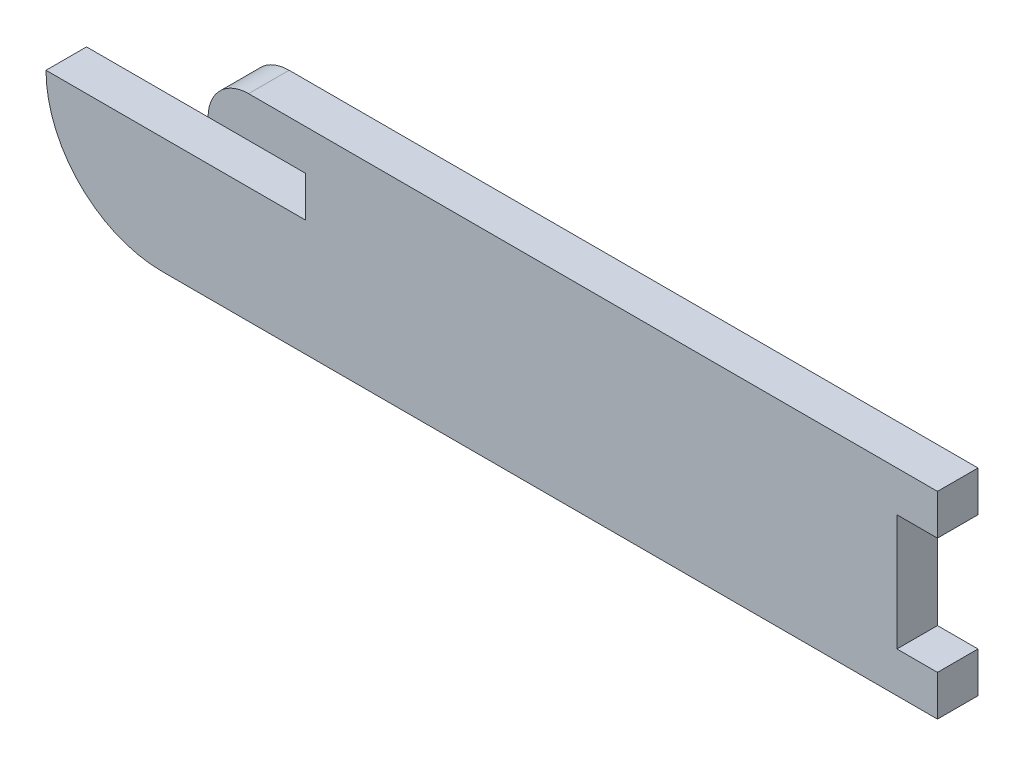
ISO-10303-21;
HEADER;
FILE_DESCRIPTION(('STEP AP214'),'2;1');
FILE_NAME('part.step','',(''),(''),'','','');
FILE_SCHEMA(('AUTOMOTIVE_DESIGN { 1 0 10303 214 1 1 1 1 }'));
ENDSEC;
DATA;
#1=APPLICATION_CONTEXT('core data for automotive mechanical design processes');
#2=APPLICATION_PROTOCOL_DEFINITION('international standard','automotive_design',2000,#1);
#3=PRODUCT_CONTEXT('',#1,'mechanical');
#4=PRODUCT('Part','Part','',(#3));
#5=PRODUCT_RELATED_PRODUCT_CATEGORY('part','',(#4));
#6=PRODUCT_DEFINITION_FORMATION('','',#4);
#7=PRODUCT_DEFINITION_CONTEXT('part definition',#1,'design');
#8=PRODUCT_DEFINITION('design','',#6,#7);
#9=PRODUCT_DEFINITION_SHAPE('','',#8);
#10=(LENGTH_UNIT() NAMED_UNIT(*) SI_UNIT(.MILLI.,.METRE.));
#11=(NAMED_UNIT(*) PLANE_ANGLE_UNIT() SI_UNIT($,.RADIAN.));
#12=(NAMED_UNIT(*) SI_UNIT($,.STERADIAN.) SOLID_ANGLE_UNIT());
#13=UNCERTAINTY_MEASURE_WITH_UNIT(LENGTH_MEASURE(1.E-05),#10,'distance_accuracy_value','');
#14=(GEOMETRIC_REPRESENTATION_CONTEXT(3) GLOBAL_UNCERTAINTY_ASSIGNED_CONTEXT((#13)) GLOBAL_UNIT_ASSIGNED_CONTEXT((#10,
#11,#12)) REPRESENTATION_CONTEXT('',''));
#15=CARTESIAN_POINT('',(0.,0.,0.));
#16=DIRECTION('',(0.,0.,1.));
#17=DIRECTION('',(1.,0.,0.));
#18=AXIS2_PLACEMENT_3D('',#15,#16,#17);
#19=CARTESIAN_POINT('',(28.575,7.72795,1.5875));
#20=DIRECTION('',(-1.,0.,0.));
#21=DIRECTION('',(0.,0.,1.));
#22=AXIS2_PLACEMENT_3D('',#19,#20,#21);
#23=PLANE('',#22);
#24=DIRECTION('',(0.,1.,0.));
#25=VECTOR('',#24,1.);
#26=CARTESIAN_POINT('',(28.575,7.72795,-1.5875));
#27=LINE('',#26,#25);
#28=CARTESIAN_POINT('',(28.575,-7.72795,-1.5875));
#29=VERTEX_POINT('',#28);
#30=CARTESIAN_POINT('',(28.575,-4.55295,-1.5875));
#31=VERTEX_POINT('',#30);
#32=EDGE_CURVE('E200',#29,#31,#27,.T.);
#33=ORIENTED_EDGE('',*,*,#32,.T.);
#34=DIRECTION('',(0.,0.,1.));
#35=VECTOR('',#34,1.);
#36=CARTESIAN_POINT('',(28.575,-4.55295,-1.5875));
#37=LINE('',#36,#35);
#38=CARTESIAN_POINT('',(28.575,-4.55295,1.5875));
#39=VERTEX_POINT('',#38);
#40=EDGE_CURVE('E182',#31,#39,#37,.T.);
#41=ORIENTED_EDGE('',*,*,#40,.T.);
#42=DIRECTION('',(0.,1.,0.));
#43=VECTOR('',#42,1.);
#44=CARTESIAN_POINT('',(28.575,7.72795,1.5875));
#45=LINE('',#44,#43);
#46=CARTESIAN_POINT('',(28.575,-7.72795,1.5875));
#47=VERTEX_POINT('',#46);
#48=EDGE_CURVE('E191',#47,#39,#45,.T.);
#49=ORIENTED_EDGE('',*,*,#48,.F.);
#50=DIRECTION('',(0.,0.,-1.));
#51=VECTOR('',#50,1.);
#52=CARTESIAN_POINT('',(28.575,-7.72795,1.5875));
#53=LINE('',#52,#51);
#54=EDGE_CURVE('E199',#47,#29,#53,.T.);
#55=ORIENTED_EDGE('',*,*,#54,.T.);
#56=EDGE_LOOP('',(#33,#41,#49,#55));
#57=FACE_BOUND('',#56,.T.);
#58=ADVANCED_FACE('F31',(#57),#23,.F.);
#59=CARTESIAN_POINT('',(28.575,4.55295,1.5875));
#60=VERTEX_POINT('',#59);
#61=CARTESIAN_POINT('',(28.575,7.72795,1.5875));
#62=VERTEX_POINT('',#61);
#63=EDGE_CURVE('E195',#60,#62,#45,.T.);
#64=ORIENTED_EDGE('',*,*,#63,.F.);
#65=DIRECTION('',(0.,0.,1.));
#66=VECTOR('',#65,1.);
#67=CARTESIAN_POINT('',(28.575,4.55295,-1.5875));
#68=LINE('',#67,#66);
#69=CARTESIAN_POINT('',(28.575,4.55295,-1.5875));
#70=VERTEX_POINT('',#69);
#71=EDGE_CURVE('E175',#70,#60,#68,.T.);
#72=ORIENTED_EDGE('',*,*,#71,.F.);
#73=CARTESIAN_POINT('',(28.575,7.72795,-1.5875));
#74=VERTEX_POINT('',#73);
#75=EDGE_CURVE('E185',#70,#74,#27,.T.);
#76=ORIENTED_EDGE('',*,*,#75,.T.);
#77=DIRECTION('',(0.,0.,-1.));
#78=VECTOR('',#77,1.);
#79=CARTESIAN_POINT('',(28.575,7.72795,1.5875));
#80=LINE('',#79,#78);
#81=EDGE_CURVE('E208',#62,#74,#80,.T.);
#82=ORIENTED_EDGE('',*,*,#81,.F.);
#83=EDGE_LOOP('',(#64,#72,#76,#82));
#84=FACE_BOUND('',#83,.T.);
#85=ADVANCED_FACE('F215',(#84),#23,.F.);
#86=CARTESIAN_POINT('',(-28.575,7.72795,1.5875));
#87=DIRECTION('',(0.,-1.,0.));
#88=DIRECTION('',(0.,0.,-1.));
#89=AXIS2_PLACEMENT_3D('',#86,#87,#88);
#90=PLANE('',#89);
#91=DIRECTION('',(-1.,0.,0.));
#92=VECTOR('',#91,1.);
#93=CARTESIAN_POINT('',(-28.575,7.72795,-1.5875));
#94=LINE('',#93,#92);
#95=CARTESIAN_POINT('',(-25.4,7.72795,-1.5875));
#96=VERTEX_POINT('',#95);
#97=EDGE_CURVE('E203',#74,#96,#94,.T.);
#98=ORIENTED_EDGE('',*,*,#97,.T.);
#99=DIRECTION('',(0.,0.,-1.));
#100=VECTOR('',#99,1.);
#101=CARTESIAN_POINT('',(-25.4,7.72795,1.5875));
#102=LINE('',#101,#100);
#103=CARTESIAN_POINT('',(-25.4,7.72795,1.5875));
#104=VERTEX_POINT('',#103);
#105=EDGE_CURVE('E39',#96,#104,#102,.F.);
#106=ORIENTED_EDGE('',*,*,#105,.T.);
#107=DIRECTION('',(-1.,0.,0.));
#108=VECTOR('',#107,1.);
#109=CARTESIAN_POINT('',(-28.575,7.72795,1.5875));
#110=LINE('',#109,#108);
#111=EDGE_CURVE('E194',#62,#104,#110,.T.);
#112=ORIENTED_EDGE('',*,*,#111,.F.);
#113=ORIENTED_EDGE('',*,*,#81,.T.);
#114=EDGE_LOOP('',(#98,#106,#112,#113));
#115=FACE_BOUND('',#114,.T.);
#116=ADVANCED_FACE('F212',(#115),#90,.F.);
#117=CARTESIAN_POINT('',(-28.575,-7.72795,1.5875));
#118=DIRECTION('',(0.,1.,0.));
#119=DIRECTION('',(0.,0.,1.));
#120=AXIS2_PLACEMENT_3D('',#117,#118,#119);
#121=PLANE('',#120);
#122=DIRECTION('',(1.,0.,0.));
#123=VECTOR('',#122,1.);
#124=CARTESIAN_POINT('',(-28.575,-7.72795,1.5875));
#125=LINE('',#124,#123);
#126=CARTESIAN_POINT('',(-32.1691,-7.72795,1.5875));
#127=VERTEX_POINT('',#126);
#128=EDGE_CURVE('E197',#127,#47,#125,.T.);
#129=ORIENTED_EDGE('',*,*,#128,.F.);
#130=DIRECTION('',(0.,0.,1.));
#131=VECTOR('',#130,1.);
#132=CARTESIAN_POINT('',(-32.1691,-7.72795,-1.5875));
#133=LINE('',#132,#131);
#134=CARTESIAN_POINT('',(-32.1691,-7.72795,-1.5875));
#135=VERTEX_POINT('',#134);
#136=EDGE_CURVE('E131',#135,#127,#133,.T.);
#137=ORIENTED_EDGE('',*,*,#136,.F.);
#138=DIRECTION('',(1.,0.,0.));
#139=VECTOR('',#138,1.);
#140=CARTESIAN_POINT('',(-28.575,-7.72795,-1.5875));
#141=LINE('',#140,#139);
#142=EDGE_CURVE('E139',#135,#29,#141,.T.);
#143=ORIENTED_EDGE('',*,*,#142,.T.);
#144=ORIENTED_EDGE('',*,*,#54,.F.);
#145=EDGE_LOOP('',(#129,#137,#143,#144));
#146=FACE_BOUND('',#145,.T.);
#147=ADVANCED_FACE('F234',(#146),#121,.F.);
#148=CARTESIAN_POINT('',(28.575,-7.72795,1.5875));
#149=DIRECTION('',(0.,0.,1.));
#150=DIRECTION('',(1.,0.,0.));
#151=AXIS2_PLACEMENT_3D('',#148,#149,#150);
#152=PLANE('',#151);
#153=ORIENTED_EDGE('',*,*,#111,.T.);
#154=CARTESIAN_POINT('',(-25.4,4.55295,1.5875));
#155=DIRECTION('',(0.,0.,1.));
#156=DIRECTION('',(1.,0.,0.));
#157=AXIS2_PLACEMENT_3D('',#154,#155,#156);
#158=CIRCLE('',#157,3.175);
#159=CARTESIAN_POINT('',(-28.575,4.55295,1.5875));
#160=VERTEX_POINT('',#159);
#161=EDGE_CURVE('E11',#104,#160,#158,.T.);
#162=ORIENTED_EDGE('',*,*,#161,.T.);
#163=DIRECTION('',(-1.,0.,0.));
#164=VECTOR('',#163,1.);
#165=CARTESIAN_POINT('',(-28.575,4.55295,1.5875));
#166=LINE('',#165,#164);
#167=CARTESIAN_POINT('',(-20.955,4.55295,1.5875));
#168=VERTEX_POINT('',#167);
#169=EDGE_CURVE('E145',#168,#160,#166,.T.);
#170=ORIENTED_EDGE('',*,*,#169,.F.);
#171=DIRECTION('',(0.,1.,0.));
#172=VECTOR('',#171,1.);
#173=CARTESIAN_POINT('',(-20.955,4.55295,1.5875));
#174=LINE('',#173,#172);
#175=CARTESIAN_POINT('',(-20.955,1.37795,1.5875));
#176=VERTEX_POINT('',#175);
#177=EDGE_CURVE('E150',#176,#168,#174,.T.);
#178=ORIENTED_EDGE('',*,*,#177,.F.);
#179=DIRECTION('',(1.,0.,0.));
#180=VECTOR('',#179,1.);
#181=CARTESIAN_POINT('',(-28.575,1.37795,1.5875));
#182=LINE('',#181,#180);
#183=CARTESIAN_POINT('',(-41.275,1.37795,1.5875));
#184=VERTEX_POINT('',#183);
#185=EDGE_CURVE('E130',#184,#176,#182,.T.);
#186=ORIENTED_EDGE('',*,*,#185,.F.);
#187=CARTESIAN_POINT('',(-32.1691,1.37795,1.5875));
#188=DIRECTION('',(0.,0.,-1.));
#189=DIRECTION('',(1.,0.,0.));
#190=AXIS2_PLACEMENT_3D('',#187,#188,#189);
#191=CIRCLE('',#190,9.1059);
#192=EDGE_CURVE('E125',#127,#184,#191,.T.);
#193=ORIENTED_EDGE('',*,*,#192,.F.);
#194=ORIENTED_EDGE('',*,*,#128,.T.);
#195=ORIENTED_EDGE('',*,*,#48,.T.);
#196=DIRECTION('',(1.,0.,0.));
#197=VECTOR('',#196,1.);
#198=CARTESIAN_POINT('',(28.575,-4.55295,1.5875));
#199=LINE('',#198,#197);
#200=CARTESIAN_POINT('',(25.4,-4.55295,1.5875));
#201=VERTEX_POINT('',#200);
#202=EDGE_CURVE('E169',#201,#39,#199,.T.);
#203=ORIENTED_EDGE('',*,*,#202,.F.);
#204=DIRECTION('',(0.,-1.,0.));
#205=VECTOR('',#204,1.);
#206=CARTESIAN_POINT('',(25.4,4.55295,1.5875));
#207=LINE('',#206,#205);
#208=CARTESIAN_POINT('',(25.4,4.55295,1.5875));
#209=VERTEX_POINT('',#208);
#210=EDGE_CURVE('E178',#209,#201,#207,.T.);
#211=ORIENTED_EDGE('',*,*,#210,.F.);
#212=DIRECTION('',(-1.,0.,0.));
#213=VECTOR('',#212,1.);
#214=CARTESIAN_POINT('',(28.575,4.55295,1.5875));
#215=LINE('',#214,#213);
#216=EDGE_CURVE('E161',#60,#209,#215,.T.);
#217=ORIENTED_EDGE('',*,*,#216,.F.);
#218=ORIENTED_EDGE('',*,*,#63,.T.);
#219=EDGE_LOOP('',(#153,#162,#170,#178,#186,#193,#194,#195,#203,#211,#217,#218));
#220=FACE_BOUND('',#219,.T.);
#221=ADVANCED_FACE('F237',(#220),#152,.T.);
#222=CARTESIAN_POINT('',(28.575,-7.72795,-1.5875));
#223=DIRECTION('',(0.,0.,1.));
#224=DIRECTION('',(1.,0.,0.));
#225=AXIS2_PLACEMENT_3D('',#222,#223,#224);
#226=PLANE('',#225);
#227=DIRECTION('',(-1.,0.,0.));
#228=VECTOR('',#227,1.);
#229=CARTESIAN_POINT('',(-28.575,4.55295,-1.5875));
#230=LINE('',#229,#228);
#231=CARTESIAN_POINT('',(-20.955,4.55295,-1.5875));
#232=VERTEX_POINT('',#231);
#233=CARTESIAN_POINT('',(-28.575,4.55295,-1.5875));
#234=VERTEX_POINT('',#233);
#235=EDGE_CURVE('E147',#232,#234,#230,.T.);
#236=ORIENTED_EDGE('',*,*,#235,.T.);
#237=CARTESIAN_POINT('',(-25.4,4.55295,-1.5875));
#238=DIRECTION('',(0.,0.,1.));
#239=DIRECTION('',(1.,0.,0.));
#240=AXIS2_PLACEMENT_3D('',#237,#238,#239);
#241=CIRCLE('',#240,3.175);
#242=EDGE_CURVE('E53',#234,#96,#241,.F.);
#243=ORIENTED_EDGE('',*,*,#242,.T.);
#244=ORIENTED_EDGE('',*,*,#97,.F.);
#245=ORIENTED_EDGE('',*,*,#75,.F.);
#246=DIRECTION('',(-1.,0.,0.));
#247=VECTOR('',#246,1.);
#248=CARTESIAN_POINT('',(28.575,4.55295,-1.5875));
#249=LINE('',#248,#247);
#250=CARTESIAN_POINT('',(25.4,4.55295,-1.5875));
#251=VERTEX_POINT('',#250);
#252=EDGE_CURVE('E165',#70,#251,#249,.T.);
#253=ORIENTED_EDGE('',*,*,#252,.T.);
#254=DIRECTION('',(0.,-1.,0.));
#255=VECTOR('',#254,1.);
#256=CARTESIAN_POINT('',(25.4,4.55295,-1.5875));
#257=LINE('',#256,#255);
#258=CARTESIAN_POINT('',(25.4,-4.55295,-1.5875));
#259=VERTEX_POINT('',#258);
#260=EDGE_CURVE('E168',#251,#259,#257,.T.);
#261=ORIENTED_EDGE('',*,*,#260,.T.);
#262=DIRECTION('',(1.,0.,0.));
#263=VECTOR('',#262,1.);
#264=CARTESIAN_POINT('',(28.575,-4.55295,-1.5875));
#265=LINE('',#264,#263);
#266=EDGE_CURVE('E172',#259,#31,#265,.T.);
#267=ORIENTED_EDGE('',*,*,#266,.T.);
#268=ORIENTED_EDGE('',*,*,#32,.F.);
#269=ORIENTED_EDGE('',*,*,#142,.F.);
#270=CARTESIAN_POINT('',(-32.1691,1.37795,-1.5875));
#271=DIRECTION('',(0.,0.,-1.));
#272=DIRECTION('',(1.,0.,0.));
#273=AXIS2_PLACEMENT_3D('',#270,#271,#272);
#274=CIRCLE('',#273,9.1059);
#275=CARTESIAN_POINT('',(-41.275,1.37795,-1.5875));
#276=VERTEX_POINT('',#275);
#277=EDGE_CURVE('E122',#135,#276,#274,.T.);
#278=ORIENTED_EDGE('',*,*,#277,.T.);
#279=DIRECTION('',(1.,0.,0.));
#280=VECTOR('',#279,1.);
#281=CARTESIAN_POINT('',(-28.575,1.37795,-1.5875));
#282=LINE('',#281,#280);
#283=CARTESIAN_POINT('',(-20.955,1.37795,-1.5875));
#284=VERTEX_POINT('',#283);
#285=EDGE_CURVE('E137',#276,#284,#282,.T.);
#286=ORIENTED_EDGE('',*,*,#285,.T.);
#287=DIRECTION('',(0.,1.,0.));
#288=VECTOR('',#287,1.);
#289=CARTESIAN_POINT('',(-20.955,4.55295,-1.5875));
#290=LINE('',#289,#288);
#291=EDGE_CURVE('E144',#284,#232,#290,.T.);
#292=ORIENTED_EDGE('',*,*,#291,.T.);
#293=EDGE_LOOP('',(#236,#243,#244,#245,#253,#261,#267,#268,#269,#278,#286,#292));
#294=FACE_BOUND('',#293,.T.);
#295=ADVANCED_FACE('F135',(#294),#226,.F.);
#296=CARTESIAN_POINT('',(28.575,-4.55295,-1.5875));
#297=DIRECTION('',(0.,-1.,0.));
#298=DIRECTION('',(1.,0.,0.));
#299=AXIS2_PLACEMENT_3D('',#296,#297,#298);
#300=PLANE('',#299);
#301=ORIENTED_EDGE('',*,*,#202,.T.);
#302=ORIENTED_EDGE('',*,*,#40,.F.);
#303=ORIENTED_EDGE('',*,*,#266,.F.);
#304=DIRECTION('',(0.,0.,1.));
#305=VECTOR('',#304,1.);
#306=CARTESIAN_POINT('',(25.4,-4.55295,-1.5875));
#307=LINE('',#306,#305);
#308=EDGE_CURVE('E186',#259,#201,#307,.T.);
#309=ORIENTED_EDGE('',*,*,#308,.T.);
#310=EDGE_LOOP('',(#301,#302,#303,#309));
#311=FACE_BOUND('',#310,.T.);
#312=ADVANCED_FACE('F228',(#311),#300,.F.);
#313=CARTESIAN_POINT('',(25.4,4.55295,-1.5875));
#314=DIRECTION('',(-1.,0.,0.));
#315=DIRECTION('',(0.,-1.,0.));
#316=AXIS2_PLACEMENT_3D('',#313,#314,#315);
#317=PLANE('',#316);
#318=ORIENTED_EDGE('',*,*,#210,.T.);
#319=ORIENTED_EDGE('',*,*,#308,.F.);
#320=ORIENTED_EDGE('',*,*,#260,.F.);
#321=DIRECTION('',(0.,0.,1.));
#322=VECTOR('',#321,1.);
#323=CARTESIAN_POINT('',(25.4,4.55295,-1.5875));
#324=LINE('',#323,#322);
#325=EDGE_CURVE('E188',#251,#209,#324,.T.);
#326=ORIENTED_EDGE('',*,*,#325,.T.);
#327=EDGE_LOOP('',(#318,#319,#320,#326));
#328=FACE_BOUND('',#327,.T.);
#329=ADVANCED_FACE('F224',(#328),#317,.F.);
#330=CARTESIAN_POINT('',(28.575,4.55295,-1.5875));
#331=DIRECTION('',(0.,1.,0.));
#332=DIRECTION('',(-1.,0.,0.));
#333=AXIS2_PLACEMENT_3D('',#330,#331,#332);
#334=PLANE('',#333);
#335=ORIENTED_EDGE('',*,*,#216,.T.);
#336=ORIENTED_EDGE('',*,*,#325,.F.);
#337=ORIENTED_EDGE('',*,*,#252,.F.);
#338=ORIENTED_EDGE('',*,*,#71,.T.);
#339=EDGE_LOOP('',(#335,#336,#337,#338));
#340=FACE_BOUND('',#339,.T.);
#341=ADVANCED_FACE('F220',(#340),#334,.F.);
#342=CARTESIAN_POINT('',(-28.575,4.55295,-1.5875));
#343=DIRECTION('',(0.,1.,0.));
#344=DIRECTION('',(0.,0.,1.));
#345=AXIS2_PLACEMENT_3D('',#342,#343,#344);
#346=PLANE('',#345);
#347=ORIENTED_EDGE('',*,*,#169,.T.);
#348=DIRECTION('',(0.,0.,1.));
#349=VECTOR('',#348,1.);
#350=CARTESIAN_POINT('',(-28.575,4.55295,-1.5875));
#351=LINE('',#350,#349);
#352=EDGE_CURVE('E158',#234,#160,#351,.T.);
#353=ORIENTED_EDGE('',*,*,#352,.F.);
#354=ORIENTED_EDGE('',*,*,#235,.F.);
#355=DIRECTION('',(0.,0.,1.));
#356=VECTOR('',#355,1.);
#357=CARTESIAN_POINT('',(-20.955,4.55295,-1.5875));
#358=LINE('',#357,#356);
#359=EDGE_CURVE('E162',#232,#168,#358,.T.);
#360=ORIENTED_EDGE('',*,*,#359,.T.);
#361=EDGE_LOOP('',(#347,#353,#354,#360));
#362=FACE_BOUND('',#361,.T.);
#363=ADVANCED_FACE('F245',(#362),#346,.F.);
#364=CARTESIAN_POINT('',(-20.955,4.55295,-1.5875));
#365=DIRECTION('',(1.,0.,0.));
#366=DIRECTION('',(0.,0.,-1.));
#367=AXIS2_PLACEMENT_3D('',#364,#365,#366);
#368=PLANE('',#367);
#369=ORIENTED_EDGE('',*,*,#177,.T.);
#370=ORIENTED_EDGE('',*,*,#359,.F.);
#371=ORIENTED_EDGE('',*,*,#291,.F.);
#372=DIRECTION('',(0.,0.,1.));
#373=VECTOR('',#372,1.);
#374=CARTESIAN_POINT('',(-20.955,1.37795,-1.5875));
#375=LINE('',#374,#373);
#376=EDGE_CURVE('E143',#284,#176,#375,.T.);
#377=ORIENTED_EDGE('',*,*,#376,.T.);
#378=EDGE_LOOP('',(#369,#370,#371,#377));
#379=FACE_BOUND('',#378,.T.);
#380=ADVANCED_FACE('F241',(#379),#368,.F.);
#381=CARTESIAN_POINT('',(-28.575,1.37795,-1.5875));
#382=DIRECTION('',(0.,-1.,0.));
#383=DIRECTION('',(0.,0.,-1.));
#384=AXIS2_PLACEMENT_3D('',#381,#382,#383);
#385=PLANE('',#384);
#386=ORIENTED_EDGE('',*,*,#185,.T.);
#387=ORIENTED_EDGE('',*,*,#376,.F.);
#388=ORIENTED_EDGE('',*,*,#285,.F.);
#389=DIRECTION('',(0.,0.,1.));
#390=VECTOR('',#389,1.);
#391=CARTESIAN_POINT('',(-41.275,1.37795,-1.5875));
#392=LINE('',#391,#390);
#393=EDGE_CURVE('E119',#276,#184,#392,.T.);
#394=ORIENTED_EDGE('',*,*,#393,.T.);
#395=EDGE_LOOP('',(#386,#387,#388,#394));
#396=FACE_BOUND('',#395,.T.);
#397=ADVANCED_FACE('F142',(#396),#385,.F.);
#398=CARTESIAN_POINT('',(-32.1691,1.37795,-1.5875));
#399=DIRECTION('',(0.,0.,1.));
#400=DIRECTION('',(1.,0.,0.));
#401=AXIS2_PLACEMENT_3D('',#398,#399,#400);
#402=CYLINDRICAL_SURFACE('',#401,9.1059);
#403=ORIENTED_EDGE('',*,*,#192,.T.);
#404=ORIENTED_EDGE('',*,*,#393,.F.);
#405=ORIENTED_EDGE('',*,*,#277,.F.);
#406=ORIENTED_EDGE('',*,*,#136,.T.);
#407=EDGE_LOOP('',(#403,#404,#405,#406));
#408=FACE_BOUND('',#407,.T.);
#409=ADVANCED_FACE('F121',(#408),#402,.T.);
#410=CARTESIAN_POINT('',(-25.4,4.55295,1.5875));
#411=DIRECTION('',(0.,0.,-1.));
#412=DIRECTION('',(-1.,0.,0.));
#413=AXIS2_PLACEMENT_3D('',#410,#411,#412);
#414=CYLINDRICAL_SURFACE('',#413,3.175);
#415=ORIENTED_EDGE('',*,*,#161,.F.);
#416=ORIENTED_EDGE('',*,*,#105,.F.);
#417=ORIENTED_EDGE('',*,*,#242,.F.);
#418=ORIENTED_EDGE('',*,*,#352,.T.);
#419=EDGE_LOOP('',(#415,#416,#417,#418));
#420=FACE_BOUND('',#419,.T.);
#421=ADVANCED_FACE('F33',(#420),#414,.T.);
#422=CLOSED_SHELL('',(#58,#85,#116,#147,#221,#295,#312,#329,#341,#363,#380,#397,#409,#421));
#423=MANIFOLD_SOLID_BREP('B2',#422);
#424=ADVANCED_BREP_SHAPE_REPRESENTATION('',(#18,#423),#14);
#425=SHAPE_DEFINITION_REPRESENTATION(#9,#424);
ENDSEC;
END-ISO-10303-21;
